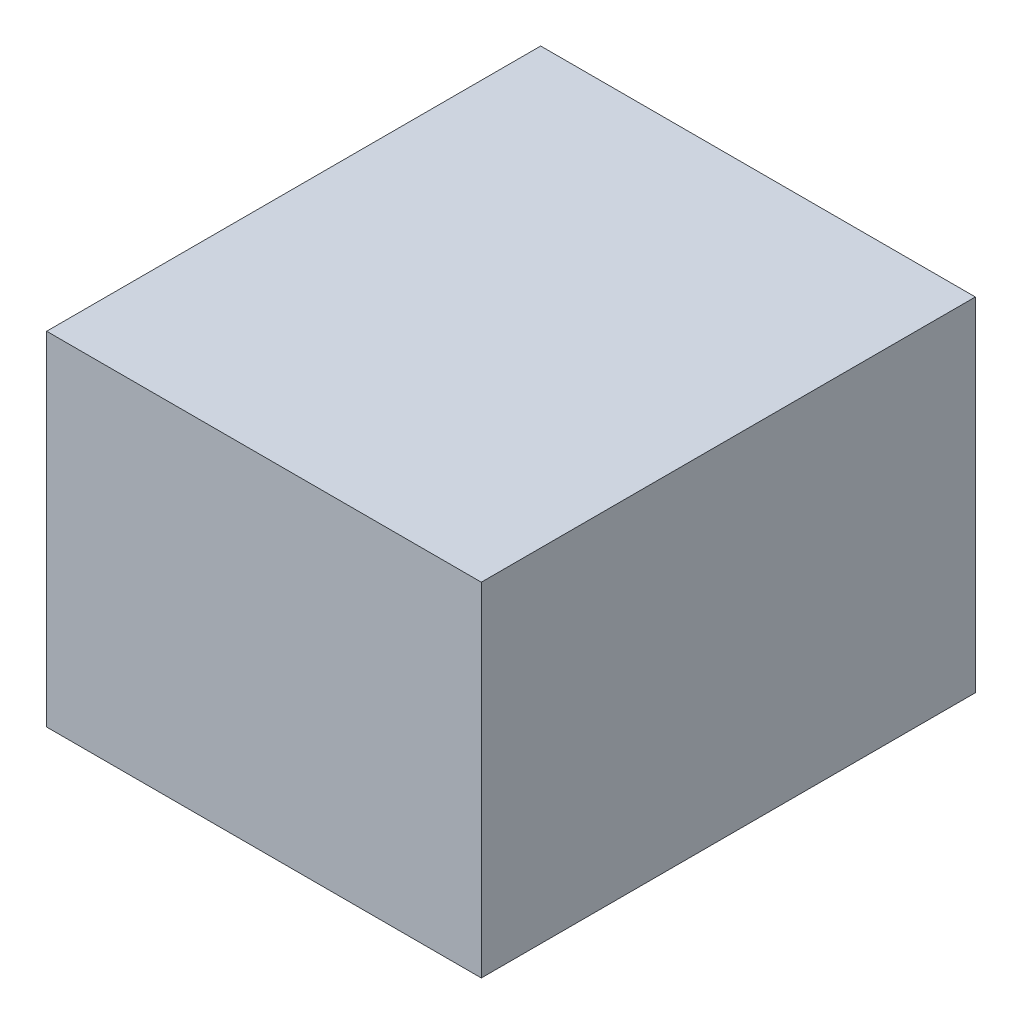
ISO-10303-21;
HEADER;
FILE_DESCRIPTION(('STEP AP214'),'2;1');
FILE_NAME('part.step','',(''),(''),'','','');
FILE_SCHEMA(('AUTOMOTIVE_DESIGN { 1 0 10303 214 1 1 1 1 }'));
ENDSEC;
DATA;
#1=APPLICATION_CONTEXT('core data for automotive mechanical design processes');
#2=APPLICATION_PROTOCOL_DEFINITION('international standard','automotive_design',2000,#1);
#3=PRODUCT_CONTEXT('',#1,'mechanical');
#4=PRODUCT('Part','Part','',(#3));
#5=PRODUCT_RELATED_PRODUCT_CATEGORY('part','',(#4));
#6=PRODUCT_DEFINITION_FORMATION('','',#4);
#7=PRODUCT_DEFINITION_CONTEXT('part definition',#1,'design');
#8=PRODUCT_DEFINITION('design','',#6,#7);
#9=PRODUCT_DEFINITION_SHAPE('','',#8);
#10=(LENGTH_UNIT() NAMED_UNIT(*) SI_UNIT(.MILLI.,.METRE.));
#11=(NAMED_UNIT(*) PLANE_ANGLE_UNIT() SI_UNIT($,.RADIAN.));
#12=(NAMED_UNIT(*) SI_UNIT($,.STERADIAN.) SOLID_ANGLE_UNIT());
#13=UNCERTAINTY_MEASURE_WITH_UNIT(LENGTH_MEASURE(1.E-05),#10,'distance_accuracy_value','');
#14=(GEOMETRIC_REPRESENTATION_CONTEXT(3) GLOBAL_UNCERTAINTY_ASSIGNED_CONTEXT((#13)) GLOBAL_UNIT_ASSIGNED_CONTEXT((#10,
#11,#12)) REPRESENTATION_CONTEXT('',''));
#15=CARTESIAN_POINT('',(0.,0.,0.));
#16=DIRECTION('',(0.,0.,1.));
#17=DIRECTION('',(1.,0.,0.));
#18=AXIS2_PLACEMENT_3D('',#15,#16,#17);
#19=CARTESIAN_POINT('',(-47.8301230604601,35.9339129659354,34.29));
#20=DIRECTION('',(1.,0.,0.));
#21=DIRECTION('',(0.,0.,-1.));
#22=AXIS2_PLACEMENT_3D('',#19,#20,#21);
#23=PLANE('',#22);
#24=DIRECTION('',(0.,-1.,0.));
#25=VECTOR('',#24,1.);
#26=CARTESIAN_POINT('',(-47.8301230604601,35.9339129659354,0.));
#27=LINE('',#26,#25);
#28=CARTESIAN_POINT('',(-47.8301230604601,35.9339129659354,0.));
#29=VERTEX_POINT('',#28);
#30=CARTESIAN_POINT('',(-47.8301230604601,12.141492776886,0.));
#31=VERTEX_POINT('',#30);
#32=EDGE_CURVE('E70',#29,#31,#27,.T.);
#33=ORIENTED_EDGE('',*,*,#32,.T.);
#34=DIRECTION('',(0.,0.,-1.));
#35=VECTOR('',#34,1.);
#36=CARTESIAN_POINT('',(-47.8301230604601,12.141492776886,34.29));
#37=LINE('',#36,#35);
#38=CARTESIAN_POINT('',(-47.8301230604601,12.141492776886,34.29));
#39=VERTEX_POINT('',#38);
#40=EDGE_CURVE('E11',#39,#31,#37,.T.);
#41=ORIENTED_EDGE('',*,*,#40,.F.);
#42=DIRECTION('',(0.,-1.,0.));
#43=VECTOR('',#42,1.);
#44=CARTESIAN_POINT('',(-47.8301230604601,35.9339129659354,34.29));
#45=LINE('',#44,#43);
#46=CARTESIAN_POINT('',(-47.8301230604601,35.9339129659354,34.29));
#47=VERTEX_POINT('',#46);
#48=EDGE_CURVE('E88',#47,#39,#45,.T.);
#49=ORIENTED_EDGE('',*,*,#48,.F.);
#50=DIRECTION('',(0.,0.,-1.));
#51=VECTOR('',#50,1.);
#52=CARTESIAN_POINT('',(-47.8301230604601,35.9339129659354,34.29));
#53=LINE('',#52,#51);
#54=EDGE_CURVE('E82',#47,#29,#53,.T.);
#55=ORIENTED_EDGE('',*,*,#54,.T.);
#56=EDGE_LOOP('',(#33,#41,#49,#55));
#57=FACE_BOUND('',#56,.T.);
#58=ADVANCED_FACE('F26',(#57),#23,.F.);
#59=CARTESIAN_POINT('',(-47.8301230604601,12.141492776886,34.29));
#60=DIRECTION('',(0.,1.,0.));
#61=DIRECTION('',(0.,0.,1.));
#62=AXIS2_PLACEMENT_3D('',#59,#60,#61);
#63=PLANE('',#62);
#64=DIRECTION('',(1.,0.,0.));
#65=VECTOR('',#64,1.);
#66=CARTESIAN_POINT('',(-47.8301230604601,12.141492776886,0.));
#67=LINE('',#66,#65);
#68=CARTESIAN_POINT('',(-17.660353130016,12.141492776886,0.));
#69=VERTEX_POINT('',#68);
#70=EDGE_CURVE('E66',#31,#69,#67,.T.);
#71=ORIENTED_EDGE('',*,*,#70,.T.);
#72=DIRECTION('',(0.,0.,-1.));
#73=VECTOR('',#72,1.);
#74=CARTESIAN_POINT('',(-17.660353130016,12.141492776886,34.29));
#75=LINE('',#74,#73);
#76=CARTESIAN_POINT('',(-17.660353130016,12.141492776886,34.29));
#77=VERTEX_POINT('',#76);
#78=EDGE_CURVE('E33',#77,#69,#75,.T.);
#79=ORIENTED_EDGE('',*,*,#78,.F.);
#80=DIRECTION('',(1.,0.,0.));
#81=VECTOR('',#80,1.);
#82=CARTESIAN_POINT('',(-47.8301230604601,12.141492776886,34.29));
#83=LINE('',#82,#81);
#84=EDGE_CURVE('E78',#39,#77,#83,.T.);
#85=ORIENTED_EDGE('',*,*,#84,.F.);
#86=ORIENTED_EDGE('',*,*,#40,.T.);
#87=EDGE_LOOP('',(#71,#79,#85,#86));
#88=FACE_BOUND('',#87,.T.);
#89=ADVANCED_FACE('F77',(#88),#63,.F.);
#90=CARTESIAN_POINT('',(-17.660353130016,35.9339129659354,34.29));
#91=DIRECTION('',(-1.,0.,0.));
#92=DIRECTION('',(0.,0.,1.));
#93=AXIS2_PLACEMENT_3D('',#90,#91,#92);
#94=PLANE('',#93);
#95=DIRECTION('',(0.,1.,0.));
#96=VECTOR('',#95,1.);
#97=CARTESIAN_POINT('',(-17.660353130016,35.9339129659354,0.));
#98=LINE('',#97,#96);
#99=CARTESIAN_POINT('',(-17.660353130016,35.9339129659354,0.));
#100=VERTEX_POINT('',#99);
#101=EDGE_CURVE('E71',#69,#100,#98,.T.);
#102=ORIENTED_EDGE('',*,*,#101,.T.);
#103=DIRECTION('',(0.,0.,-1.));
#104=VECTOR('',#103,1.);
#105=CARTESIAN_POINT('',(-17.660353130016,35.9339129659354,34.29));
#106=LINE('',#105,#104);
#107=CARTESIAN_POINT('',(-17.660353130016,35.9339129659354,34.29));
#108=VERTEX_POINT('',#107);
#109=EDGE_CURVE('E94',#108,#100,#106,.T.);
#110=ORIENTED_EDGE('',*,*,#109,.F.);
#111=DIRECTION('',(0.,1.,0.));
#112=VECTOR('',#111,1.);
#113=CARTESIAN_POINT('',(-17.660353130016,35.9339129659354,34.29));
#114=LINE('',#113,#112);
#115=EDGE_CURVE('E45',#77,#108,#114,.T.);
#116=ORIENTED_EDGE('',*,*,#115,.F.);
#117=ORIENTED_EDGE('',*,*,#78,.T.);
#118=EDGE_LOOP('',(#102,#110,#116,#117));
#119=FACE_BOUND('',#118,.T.);
#120=ADVANCED_FACE('F97',(#119),#94,.F.);
#121=CARTESIAN_POINT('',(-47.8301230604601,35.9339129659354,34.29));
#122=DIRECTION('',(0.,-1.,0.));
#123=DIRECTION('',(0.,0.,-1.));
#124=AXIS2_PLACEMENT_3D('',#121,#122,#123);
#125=PLANE('',#124);
#126=DIRECTION('',(-1.,0.,0.));
#127=VECTOR('',#126,1.);
#128=CARTESIAN_POINT('',(-47.8301230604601,35.9339129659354,0.));
#129=LINE('',#128,#127);
#130=EDGE_CURVE('E86',#100,#29,#129,.T.);
#131=ORIENTED_EDGE('',*,*,#130,.T.);
#132=ORIENTED_EDGE('',*,*,#54,.F.);
#133=DIRECTION('',(-1.,0.,0.));
#134=VECTOR('',#133,1.);
#135=CARTESIAN_POINT('',(-47.8301230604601,35.9339129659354,34.29));
#136=LINE('',#135,#134);
#137=EDGE_CURVE('E40',#108,#47,#136,.T.);
#138=ORIENTED_EDGE('',*,*,#137,.F.);
#139=ORIENTED_EDGE('',*,*,#109,.T.);
#140=EDGE_LOOP('',(#131,#132,#138,#139));
#141=FACE_BOUND('',#140,.T.);
#142=ADVANCED_FACE('F99',(#141),#125,.F.);
#143=CARTESIAN_POINT('',(-47.8301230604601,12.141492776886,34.29));
#144=DIRECTION('',(0.,0.,1.));
#145=DIRECTION('',(1.,0.,0.));
#146=AXIS2_PLACEMENT_3D('',#143,#144,#145);
#147=PLANE('',#146);
#148=ORIENTED_EDGE('',*,*,#48,.T.);
#149=ORIENTED_EDGE('',*,*,#84,.T.);
#150=ORIENTED_EDGE('',*,*,#115,.T.);
#151=ORIENTED_EDGE('',*,*,#137,.T.);
#152=EDGE_LOOP('',(#148,#149,#150,#151));
#153=FACE_BOUND('',#152,.T.);
#154=ADVANCED_FACE('F100',(#153),#147,.T.);
#155=CARTESIAN_POINT('',(-47.8301230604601,12.141492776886,0.));
#156=DIRECTION('',(0.,0.,1.));
#157=DIRECTION('',(1.,0.,0.));
#158=AXIS2_PLACEMENT_3D('',#155,#156,#157);
#159=PLANE('',#158);
#160=ORIENTED_EDGE('',*,*,#32,.F.);
#161=ORIENTED_EDGE('',*,*,#130,.F.);
#162=ORIENTED_EDGE('',*,*,#101,.F.);
#163=ORIENTED_EDGE('',*,*,#70,.F.);
#164=EDGE_LOOP('',(#160,#161,#162,#163));
#165=FACE_BOUND('',#164,.T.);
#166=ADVANCED_FACE('F67',(#165),#159,.F.);
#167=CLOSED_SHELL('',(#58,#89,#120,#142,#154,#166));
#168=MANIFOLD_SOLID_BREP('B2',#167);
#169=ADVANCED_BREP_SHAPE_REPRESENTATION('',(#18,#168),#14);
#170=SHAPE_DEFINITION_REPRESENTATION(#9,#169);
ENDSEC;
END-ISO-10303-21;
